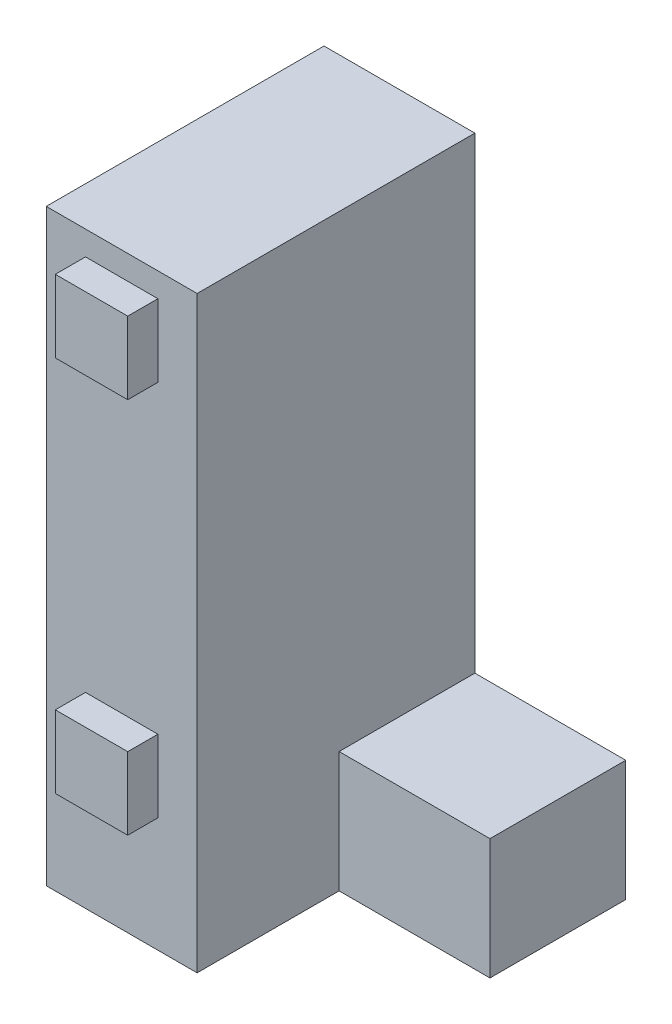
ISO-10303-21;
HEADER;
FILE_DESCRIPTION(('STEP AP214'),'2;1');
FILE_NAME('part.step','',(''),(''),'','','');
FILE_SCHEMA(('AUTOMOTIVE_DESIGN { 1 0 10303 214 1 1 1 1 }'));
ENDSEC;
DATA;
#1=APPLICATION_CONTEXT('core data for automotive mechanical design processes');
#2=APPLICATION_PROTOCOL_DEFINITION('international standard','automotive_design',2000,#1);
#3=PRODUCT_CONTEXT('',#1,'mechanical');
#4=PRODUCT('Part','Part','',(#3));
#5=PRODUCT_RELATED_PRODUCT_CATEGORY('part','',(#4));
#6=PRODUCT_DEFINITION_FORMATION('','',#4);
#7=PRODUCT_DEFINITION_CONTEXT('part definition',#1,'design');
#8=PRODUCT_DEFINITION('design','',#6,#7);
#9=PRODUCT_DEFINITION_SHAPE('','',#8);
#10=(LENGTH_UNIT() NAMED_UNIT(*) SI_UNIT(.MILLI.,.METRE.));
#11=(NAMED_UNIT(*) PLANE_ANGLE_UNIT() SI_UNIT($,.RADIAN.));
#12=(NAMED_UNIT(*) SI_UNIT($,.STERADIAN.) SOLID_ANGLE_UNIT());
#13=UNCERTAINTY_MEASURE_WITH_UNIT(LENGTH_MEASURE(1.E-05),#10,'distance_accuracy_value','');
#14=(GEOMETRIC_REPRESENTATION_CONTEXT(3) GLOBAL_UNCERTAINTY_ASSIGNED_CONTEXT((#13)) GLOBAL_UNIT_ASSIGNED_CONTEXT((#10,
#11,#12)) REPRESENTATION_CONTEXT('',''));
#15=CARTESIAN_POINT('',(0.,0.,0.));
#16=DIRECTION('',(0.,0.,1.));
#17=DIRECTION('',(1.,0.,0.));
#18=AXIS2_PLACEMENT_3D('',#15,#16,#17);
#19=CARTESIAN_POINT('',(73.,250.,-142.943134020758));
#20=DIRECTION('',(0.,0.,1.));
#21=DIRECTION('',(1.,0.,0.));
#22=AXIS2_PLACEMENT_3D('',#19,#20,#21);
#23=PLANE('',#22);
#24=DIRECTION('',(0.,1.,0.));
#25=VECTOR('',#24,1.);
#26=CARTESIAN_POINT('',(30.,250.,-142.943134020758));
#27=LINE('',#26,#25);
#28=CARTESIAN_POINT('',(30.,0.,-142.943134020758));
#29=VERTEX_POINT('',#28);
#30=CARTESIAN_POINT('',(30.,195.,-142.943134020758));
#31=VERTEX_POINT('',#30);
#32=EDGE_CURVE('E333',#29,#31,#27,.T.);
#33=ORIENTED_EDGE('',*,*,#32,.T.);
#34=DIRECTION('',(1.,0.,0.));
#35=VECTOR('',#34,1.);
#36=CARTESIAN_POINT('',(-91.,195.,-142.943134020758));
#37=LINE('',#36,#35);
#38=CARTESIAN_POINT('',(-20.,195.,-142.943134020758));
#39=VERTEX_POINT('',#38);
#40=EDGE_CURVE('E569',#39,#31,#37,.T.);
#41=ORIENTED_EDGE('',*,*,#40,.F.);
#42=DIRECTION('',(0.,-1.,0.));
#43=VECTOR('',#42,1.);
#44=CARTESIAN_POINT('',(-20.,250.,-142.943134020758));
#45=LINE('',#44,#43);
#46=CARTESIAN_POINT('',(-19.9999999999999,0.,-142.943134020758));
#47=VERTEX_POINT('',#46);
#48=EDGE_CURVE('E332',#39,#47,#45,.T.);
#49=ORIENTED_EDGE('',*,*,#48,.T.);
#50=DIRECTION('',(-1.,0.,0.));
#51=VECTOR('',#50,1.);
#52=CARTESIAN_POINT('',(73.,0.,-142.943134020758));
#53=LINE('',#52,#51);
#54=EDGE_CURVE('E328',#29,#47,#53,.T.);
#55=ORIENTED_EDGE('',*,*,#54,.F.);
#56=EDGE_LOOP('',(#33,#41,#49,#55));
#57=FACE_BOUND('',#56,.T.);
#58=DIRECTION('',(-1.,0.,0.));
#59=VECTOR('',#58,1.);
#60=CARTESIAN_POINT('',(-7.,62.,-142.943134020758));
#61=LINE('',#60,#59);
#62=CARTESIAN_POINT('',(17.,62.,-142.943134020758));
#63=VERTEX_POINT('',#62);
#64=CARTESIAN_POINT('',(-7.,62.,-142.943134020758));
#65=VERTEX_POINT('',#64);
#66=EDGE_CURVE('E289',#63,#65,#61,.T.);
#67=ORIENTED_EDGE('',*,*,#66,.F.);
#68=DIRECTION('',(0.,1.,0.));
#69=VECTOR('',#68,1.);
#70=CARTESIAN_POINT('',(17.,38.,-142.943134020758));
#71=LINE('',#70,#69);
#72=CARTESIAN_POINT('',(17.,38.,-142.943134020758));
#73=VERTEX_POINT('',#72);
#74=EDGE_CURVE('E284',#73,#63,#71,.T.);
#75=ORIENTED_EDGE('',*,*,#74,.F.);
#76=DIRECTION('',(1.,0.,0.));
#77=VECTOR('',#76,1.);
#78=CARTESIAN_POINT('',(-7.,38.,-142.943134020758));
#79=LINE('',#78,#77);
#80=CARTESIAN_POINT('',(-6.99999999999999,38.,-142.943134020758));
#81=VERTEX_POINT('',#80);
#82=EDGE_CURVE('E299',#81,#73,#79,.T.);
#83=ORIENTED_EDGE('',*,*,#82,.F.);
#84=DIRECTION('',(0.,-1.,0.));
#85=VECTOR('',#84,1.);
#86=CARTESIAN_POINT('',(-7.,38.,-142.943134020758));
#87=LINE('',#86,#85);
#88=EDGE_CURVE('E311',#65,#81,#87,.T.);
#89=ORIENTED_EDGE('',*,*,#88,.F.);
#90=EDGE_LOOP('',(#67,#75,#83,#89));
#91=FACE_BOUND('',#90,.T.);
#92=DIRECTION('',(-1.,0.,0.));
#93=VECTOR('',#92,1.);
#94=CARTESIAN_POINT('',(-7.00000000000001,187.,-142.943134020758));
#95=LINE('',#94,#93);
#96=CARTESIAN_POINT('',(17.,187.,-142.943134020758));
#97=VERTEX_POINT('',#96);
#98=CARTESIAN_POINT('',(-7.00000000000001,187.,-142.943134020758));
#99=VERTEX_POINT('',#98);
#100=EDGE_CURVE('E1091',#97,#99,#95,.T.);
#101=ORIENTED_EDGE('',*,*,#100,.F.);
#102=DIRECTION('',(0.,1.,0.));
#103=VECTOR('',#102,1.);
#104=CARTESIAN_POINT('',(17.,163.,-142.943134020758));
#105=LINE('',#104,#103);
#106=CARTESIAN_POINT('',(17.,163.,-142.943134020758));
#107=VERTEX_POINT('',#106);
#108=EDGE_CURVE('E281',#107,#97,#105,.T.);
#109=ORIENTED_EDGE('',*,*,#108,.F.);
#110=DIRECTION('',(1.,0.,0.));
#111=VECTOR('',#110,1.);
#112=CARTESIAN_POINT('',(-7.00000000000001,163.,-142.943134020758));
#113=LINE('',#112,#111);
#114=CARTESIAN_POINT('',(-7.00000000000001,163.,-142.943134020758));
#115=VERTEX_POINT('',#114);
#116=EDGE_CURVE('E277',#115,#107,#113,.T.);
#117=ORIENTED_EDGE('',*,*,#116,.F.);
#118=DIRECTION('',(0.,-1.,0.));
#119=VECTOR('',#118,1.);
#120=CARTESIAN_POINT('',(-7.00000000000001,163.,-142.943134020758));
#121=LINE('',#120,#119);
#122=EDGE_CURVE('E1087',#99,#115,#121,.T.);
#123=ORIENTED_EDGE('',*,*,#122,.F.);
#124=EDGE_LOOP('',(#101,#109,#117,#123));
#125=FACE_BOUND('',#124,.T.);
#126=ADVANCED_FACE('F52',(#57,#91,#125),#23,.T.);
#127=CARTESIAN_POINT('',(-20.,250.,0.));
#128=DIRECTION('',(1.,0.,0.));
#129=DIRECTION('',(0.,0.,-1.));
#130=AXIS2_PLACEMENT_3D('',#127,#128,#129);
#131=PLANE('',#130);
#132=ORIENTED_EDGE('',*,*,#48,.F.);
#133=DIRECTION('',(0.,0.,-1.));
#134=VECTOR('',#133,1.);
#135=CARTESIAN_POINT('',(-20.,195.,0.));
#136=LINE('',#135,#134);
#137=CARTESIAN_POINT('',(-19.9999999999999,195.,-235.));
#138=VERTEX_POINT('',#137);
#139=EDGE_CURVE('E61',#39,#138,#136,.T.);
#140=ORIENTED_EDGE('',*,*,#139,.T.);
#141=DIRECTION('',(0.,-1.,0.));
#142=VECTOR('',#141,1.);
#143=CARTESIAN_POINT('',(-20.,250.,-235.));
#144=LINE('',#143,#142);
#145=CARTESIAN_POINT('',(-19.9999999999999,0.,-235.));
#146=VERTEX_POINT('',#145);
#147=EDGE_CURVE('E561',#138,#146,#144,.T.);
#148=ORIENTED_EDGE('',*,*,#147,.T.);
#149=DIRECTION('',(0.,0.,-1.));
#150=VECTOR('',#149,1.);
#151=CARTESIAN_POINT('',(-20.,0.,0.));
#152=LINE('',#151,#150);
#153=EDGE_CURVE('E547',#47,#146,#152,.T.);
#154=ORIENTED_EDGE('',*,*,#153,.F.);
#155=EDGE_LOOP('',(#132,#140,#148,#154));
#156=FACE_BOUND('',#155,.T.);
#157=ADVANCED_FACE('F577',(#156),#131,.F.);
#158=CARTESIAN_POINT('',(30.,250.,-150.));
#159=DIRECTION('',(-1.,0.,0.));
#160=DIRECTION('',(0.,0.,1.));
#161=AXIS2_PLACEMENT_3D('',#158,#159,#160);
#162=PLANE('',#161);
#163=ORIENTED_EDGE('',*,*,#32,.F.);
#164=DIRECTION('',(0.,0.,1.));
#165=VECTOR('',#164,1.);
#166=CARTESIAN_POINT('',(30.,0.,-235.));
#167=LINE('',#166,#165);
#168=CARTESIAN_POINT('',(30.,0.,-190.));
#169=VERTEX_POINT('',#168);
#170=EDGE_CURVE('E540',#169,#29,#167,.T.);
#171=ORIENTED_EDGE('',*,*,#170,.F.);
#172=DIRECTION('',(0.,1.,0.));
#173=VECTOR('',#172,1.);
#174=CARTESIAN_POINT('',(30.,0.,-190.));
#175=LINE('',#174,#173);
#176=CARTESIAN_POINT('',(30.,40.,-190.));
#177=VERTEX_POINT('',#176);
#178=EDGE_CURVE('E524',#169,#177,#175,.T.);
#179=ORIENTED_EDGE('',*,*,#178,.T.);
#180=DIRECTION('',(0.,0.,1.));
#181=VECTOR('',#180,1.);
#182=CARTESIAN_POINT('',(30.,40.,-190.));
#183=LINE('',#182,#181);
#184=CARTESIAN_POINT('',(30.,40.,-235.));
#185=VERTEX_POINT('',#184);
#186=EDGE_CURVE('E375',#185,#177,#183,.T.);
#187=ORIENTED_EDGE('',*,*,#186,.F.);
#188=DIRECTION('',(0.,1.,0.));
#189=VECTOR('',#188,1.);
#190=CARTESIAN_POINT('',(30.,250.,-235.));
#191=LINE('',#190,#189);
#192=CARTESIAN_POINT('',(30.,195.,-235.));
#193=VERTEX_POINT('',#192);
#194=EDGE_CURVE('E12',#185,#193,#191,.T.);
#195=ORIENTED_EDGE('',*,*,#194,.T.);
#196=DIRECTION('',(0.,0.,-1.));
#197=VECTOR('',#196,1.);
#198=CARTESIAN_POINT('',(30.,195.,-142.943134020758));
#199=LINE('',#198,#197);
#200=EDGE_CURVE('E565',#31,#193,#199,.T.);
#201=ORIENTED_EDGE('',*,*,#200,.F.);
#202=EDGE_LOOP('',(#163,#171,#179,#187,#195,#201));
#203=FACE_BOUND('',#202,.T.);
#204=ADVANCED_FACE('F54',(#203),#162,.F.);
#205=CARTESIAN_POINT('',(0.,0.,0.));
#206=DIRECTION('',(0.,-1.,0.));
#207=DIRECTION('',(0.,0.,-1.));
#208=AXIS2_PLACEMENT_3D('',#205,#206,#207);
#209=PLANE('',#208);
#210=ORIENTED_EDGE('',*,*,#170,.T.);
#211=ORIENTED_EDGE('',*,*,#54,.T.);
#212=ORIENTED_EDGE('',*,*,#153,.T.);
#213=DIRECTION('',(-1.,0.,0.));
#214=VECTOR('',#213,1.);
#215=CARTESIAN_POINT('',(0.,0.,-235.));
#216=LINE('',#215,#214);
#217=CARTESIAN_POINT('',(80.,0.,-235.));
#218=VERTEX_POINT('',#217);
#219=EDGE_CURVE('E557',#218,#146,#216,.T.);
#220=ORIENTED_EDGE('',*,*,#219,.F.);
#221=DIRECTION('',(0.,0.,-1.));
#222=VECTOR('',#221,1.);
#223=CARTESIAN_POINT('',(80.,0.,-235.));
#224=LINE('',#223,#222);
#225=CARTESIAN_POINT('',(80.,0.,-190.));
#226=VERTEX_POINT('',#225);
#227=EDGE_CURVE('E519',#226,#218,#224,.T.);
#228=ORIENTED_EDGE('',*,*,#227,.F.);
#229=DIRECTION('',(1.,0.,0.));
#230=VECTOR('',#229,1.);
#231=CARTESIAN_POINT('',(80.,0.,-190.));
#232=LINE('',#231,#230);
#233=EDGE_CURVE('E515',#169,#226,#232,.T.);
#234=ORIENTED_EDGE('',*,*,#233,.F.);
#235=EDGE_LOOP('',(#210,#211,#212,#220,#228,#234));
#236=FACE_BOUND('',#235,.T.);
#237=ADVANCED_FACE('F590',(#236),#209,.T.);
#238=CARTESIAN_POINT('',(0.,195.,0.));
#239=DIRECTION('',(0.,-1.,0.));
#240=DIRECTION('',(0.,0.,-1.));
#241=AXIS2_PLACEMENT_3D('',#238,#239,#240);
#242=PLANE('',#241);
#243=ORIENTED_EDGE('',*,*,#200,.T.);
#244=DIRECTION('',(1.,0.,0.));
#245=VECTOR('',#244,1.);
#246=CARTESIAN_POINT('',(230.,195.,-235.));
#247=LINE('',#246,#245);
#248=EDGE_CURVE('E550',#138,#193,#247,.T.);
#249=ORIENTED_EDGE('',*,*,#248,.F.);
#250=ORIENTED_EDGE('',*,*,#139,.F.);
#251=ORIENTED_EDGE('',*,*,#40,.T.);
#252=EDGE_LOOP('',(#243,#249,#250,#251));
#253=FACE_BOUND('',#252,.T.);
#254=ADVANCED_FACE('F581',(#253),#242,.F.);
#255=CARTESIAN_POINT('',(230.,-105.,-235.));
#256=DIRECTION('',(0.,0.,1.));
#257=DIRECTION('',(1.,0.,0.));
#258=AXIS2_PLACEMENT_3D('',#255,#256,#257);
#259=PLANE('',#258);
#260=DIRECTION('',(0.,-1.,0.));
#261=VECTOR('',#260,1.);
#262=CARTESIAN_POINT('',(15.075,162.075,-235.));
#263=LINE('',#262,#261);
#264=CARTESIAN_POINT('',(15.075,162.075,-235.));
#265=VERTEX_POINT('',#264);
#266=CARTESIAN_POINT('',(15.075,141.925,-235.));
#267=VERTEX_POINT('',#266);
#268=EDGE_CURVE('E360',#265,#267,#263,.T.);
#269=ORIENTED_EDGE('',*,*,#268,.F.);
#270=DIRECTION('',(1.,0.,0.));
#271=VECTOR('',#270,1.);
#272=CARTESIAN_POINT('',(-5.07500000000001,162.075,-235.));
#273=LINE('',#272,#271);
#274=CARTESIAN_POINT('',(-5.07500000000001,162.075,-235.));
#275=VERTEX_POINT('',#274);
#276=EDGE_CURVE('E357',#275,#265,#273,.T.);
#277=ORIENTED_EDGE('',*,*,#276,.F.);
#278=DIRECTION('',(0.,1.,0.));
#279=VECTOR('',#278,1.);
#280=CARTESIAN_POINT('',(-5.07500000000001,141.925,-235.));
#281=LINE('',#280,#279);
#282=CARTESIAN_POINT('',(-5.07500000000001,141.925,-235.));
#283=VERTEX_POINT('',#282);
#284=EDGE_CURVE('E344',#283,#275,#281,.T.);
#285=ORIENTED_EDGE('',*,*,#284,.F.);
#286=DIRECTION('',(-1.,0.,0.));
#287=VECTOR('',#286,1.);
#288=CARTESIAN_POINT('',(15.075,141.925,-235.));
#289=LINE('',#288,#287);
#290=EDGE_CURVE('E365',#267,#283,#289,.T.);
#291=ORIENTED_EDGE('',*,*,#290,.F.);
#292=EDGE_LOOP('',(#269,#277,#285,#291));
#293=FACE_BOUND('',#292,.T.);
#294=DIRECTION('',(0.,-1.,0.));
#295=VECTOR('',#294,1.);
#296=CARTESIAN_POINT('',(15.075,109.075,-235.));
#297=LINE('',#296,#295);
#298=CARTESIAN_POINT('',(15.075,109.075,-235.));
#299=VERTEX_POINT('',#298);
#300=CARTESIAN_POINT('',(15.075,88.925,-235.));
#301=VERTEX_POINT('',#300);
#302=EDGE_CURVE('E409',#299,#301,#297,.T.);
#303=ORIENTED_EDGE('',*,*,#302,.F.);
#304=DIRECTION('',(1.,0.,0.));
#305=VECTOR('',#304,1.);
#306=CARTESIAN_POINT('',(-5.07499999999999,109.075,-235.));
#307=LINE('',#306,#305);
#308=CARTESIAN_POINT('',(-5.07499999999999,109.075,-235.));
#309=VERTEX_POINT('',#308);
#310=EDGE_CURVE('E361',#309,#299,#307,.T.);
#311=ORIENTED_EDGE('',*,*,#310,.F.);
#312=DIRECTION('',(0.,1.,0.));
#313=VECTOR('',#312,1.);
#314=CARTESIAN_POINT('',(-5.07499999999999,88.925,-235.));
#315=LINE('',#314,#313);
#316=CARTESIAN_POINT('',(-5.07499999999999,88.925,-235.));
#317=VERTEX_POINT('',#316);
#318=EDGE_CURVE('E400',#317,#309,#315,.T.);
#319=ORIENTED_EDGE('',*,*,#318,.F.);
#320=DIRECTION('',(-1.,0.,0.));
#321=VECTOR('',#320,1.);
#322=CARTESIAN_POINT('',(15.075,88.925,-235.));
#323=LINE('',#322,#321);
#324=EDGE_CURVE('E404',#301,#317,#323,.T.);
#325=ORIENTED_EDGE('',*,*,#324,.F.);
#326=EDGE_LOOP('',(#303,#311,#319,#325));
#327=FACE_BOUND('',#326,.T.);
#328=DIRECTION('',(0.,-1.,0.));
#329=VECTOR('',#328,1.);
#330=CARTESIAN_POINT('',(15.075,56.075,-235.));
#331=LINE('',#330,#329);
#332=CARTESIAN_POINT('',(15.075,56.075,-235.));
#333=VERTEX_POINT('',#332);
#334=CARTESIAN_POINT('',(15.075,35.925,-235.));
#335=VERTEX_POINT('',#334);
#336=EDGE_CURVE('E453',#333,#335,#331,.T.);
#337=ORIENTED_EDGE('',*,*,#336,.F.);
#338=DIRECTION('',(1.,0.,0.));
#339=VECTOR('',#338,1.);
#340=CARTESIAN_POINT('',(-5.07500000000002,56.075,-235.));
#341=LINE('',#340,#339);
#342=CARTESIAN_POINT('',(-5.07500000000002,56.075,-235.));
#343=VERTEX_POINT('',#342);
#344=EDGE_CURVE('E399',#343,#333,#341,.T.);
#345=ORIENTED_EDGE('',*,*,#344,.F.);
#346=DIRECTION('',(0.,1.,0.));
#347=VECTOR('',#346,1.);
#348=CARTESIAN_POINT('',(-5.07500000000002,35.925,-235.));
#349=LINE('',#348,#347);
#350=CARTESIAN_POINT('',(-5.07500000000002,35.925,-235.));
#351=VERTEX_POINT('',#350);
#352=EDGE_CURVE('E444',#351,#343,#349,.T.);
#353=ORIENTED_EDGE('',*,*,#352,.F.);
#354=DIRECTION('',(-1.,0.,0.));
#355=VECTOR('',#354,1.);
#356=CARTESIAN_POINT('',(15.075,35.925,-235.));
#357=LINE('',#356,#355);
#358=EDGE_CURVE('E448',#335,#351,#357,.T.);
#359=ORIENTED_EDGE('',*,*,#358,.F.);
#360=EDGE_LOOP('',(#337,#345,#353,#359));
#361=FACE_BOUND('',#360,.T.);
#362=DIRECTION('',(0.,-1.,0.));
#363=VECTOR('',#362,1.);
#364=CARTESIAN_POINT('',(62.075,30.075,-235.));
#365=LINE('',#364,#363);
#366=CARTESIAN_POINT('',(62.075,30.075,-235.));
#367=VERTEX_POINT('',#366);
#368=CARTESIAN_POINT('',(62.075,9.92500000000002,-235.));
#369=VERTEX_POINT('',#368);
#370=EDGE_CURVE('E495',#367,#369,#365,.T.);
#371=ORIENTED_EDGE('',*,*,#370,.F.);
#372=DIRECTION('',(1.,0.,0.));
#373=VECTOR('',#372,1.);
#374=CARTESIAN_POINT('',(41.925,30.075,-235.));
#375=LINE('',#374,#373);
#376=CARTESIAN_POINT('',(41.925,30.075,-235.));
#377=VERTEX_POINT('',#376);
#378=EDGE_CURVE('E443',#377,#367,#375,.T.);
#379=ORIENTED_EDGE('',*,*,#378,.F.);
#380=DIRECTION('',(0.,1.,0.));
#381=VECTOR('',#380,1.);
#382=CARTESIAN_POINT('',(41.925,9.92500000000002,-235.));
#383=LINE('',#382,#381);
#384=CARTESIAN_POINT('',(41.925,9.92500000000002,-235.));
#385=VERTEX_POINT('',#384);
#386=EDGE_CURVE('E486',#385,#377,#383,.T.);
#387=ORIENTED_EDGE('',*,*,#386,.F.);
#388=DIRECTION('',(-1.,0.,0.));
#389=VECTOR('',#388,1.);
#390=CARTESIAN_POINT('',(62.075,9.92500000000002,-235.));
#391=LINE('',#390,#389);
#392=EDGE_CURVE('E490',#369,#385,#391,.T.);
#393=ORIENTED_EDGE('',*,*,#392,.F.);
#394=EDGE_LOOP('',(#371,#379,#387,#393));
#395=FACE_BOUND('',#394,.T.);
#396=ORIENTED_EDGE('',*,*,#219,.T.);
#397=ORIENTED_EDGE('',*,*,#147,.F.);
#398=ORIENTED_EDGE('',*,*,#248,.T.);
#399=ORIENTED_EDGE('',*,*,#194,.F.);
#400=DIRECTION('',(-1.,0.,0.));
#401=VECTOR('',#400,1.);
#402=CARTESIAN_POINT('',(30.,40.,-235.));
#403=LINE('',#402,#401);
#404=CARTESIAN_POINT('',(80.,40.,-235.));
#405=VERTEX_POINT('',#404);
#406=EDGE_CURVE('E520',#405,#185,#403,.T.);
#407=ORIENTED_EDGE('',*,*,#406,.F.);
#408=DIRECTION('',(0.,1.,0.));
#409=VECTOR('',#408,1.);
#410=CARTESIAN_POINT('',(80.,0.,-235.));
#411=LINE('',#410,#409);
#412=EDGE_CURVE('E537',#218,#405,#411,.T.);
#413=ORIENTED_EDGE('',*,*,#412,.F.);
#414=EDGE_LOOP('',(#396,#397,#398,#399,#407,#413));
#415=FACE_BOUND('',#414,.T.);
#416=ADVANCED_FACE('F585',(#293,#327,#361,#395,#415),#259,.F.);
#417=CARTESIAN_POINT('',(80.,0.,-235.));
#418=DIRECTION('',(1.,0.,0.));
#419=DIRECTION('',(0.,0.,-1.));
#420=AXIS2_PLACEMENT_3D('',#417,#418,#419);
#421=PLANE('',#420);
#422=DIRECTION('',(0.,0.,-1.));
#423=VECTOR('',#422,1.);
#424=CARTESIAN_POINT('',(80.,40.,-235.));
#425=LINE('',#424,#423);
#426=CARTESIAN_POINT('',(80.,40.,-190.));
#427=VERTEX_POINT('',#426);
#428=EDGE_CURVE('E531',#427,#405,#425,.T.);
#429=ORIENTED_EDGE('',*,*,#428,.F.);
#430=DIRECTION('',(0.,1.,0.));
#431=VECTOR('',#430,1.);
#432=CARTESIAN_POINT('',(80.,0.,-190.));
#433=LINE('',#432,#431);
#434=EDGE_CURVE('E541',#226,#427,#433,.T.);
#435=ORIENTED_EDGE('',*,*,#434,.F.);
#436=ORIENTED_EDGE('',*,*,#227,.T.);
#437=ORIENTED_EDGE('',*,*,#412,.T.);
#438=EDGE_LOOP('',(#429,#435,#436,#437));
#439=FACE_BOUND('',#438,.T.);
#440=ADVANCED_FACE('F605',(#439),#421,.T.);
#441=CARTESIAN_POINT('',(80.,0.,-190.));
#442=DIRECTION('',(0.,0.,1.));
#443=DIRECTION('',(1.,0.,0.));
#444=AXIS2_PLACEMENT_3D('',#441,#442,#443);
#445=PLANE('',#444);
#446=DIRECTION('',(1.,0.,0.));
#447=VECTOR('',#446,1.);
#448=CARTESIAN_POINT('',(80.,40.,-190.));
#449=LINE('',#448,#447);
#450=EDGE_CURVE('E527',#177,#427,#449,.T.);
#451=ORIENTED_EDGE('',*,*,#450,.F.);
#452=ORIENTED_EDGE('',*,*,#178,.F.);
#453=ORIENTED_EDGE('',*,*,#233,.T.);
#454=ORIENTED_EDGE('',*,*,#434,.T.);
#455=EDGE_LOOP('',(#451,#452,#453,#454));
#456=FACE_BOUND('',#455,.T.);
#457=ADVANCED_FACE('F602',(#456),#445,.T.);
#458=CARTESIAN_POINT('',(0.,40.,0.));
#459=DIRECTION('',(0.,-1.,0.));
#460=DIRECTION('',(0.,0.,-1.));
#461=AXIS2_PLACEMENT_3D('',#458,#459,#460);
#462=PLANE('',#461);
#463=ORIENTED_EDGE('',*,*,#186,.T.);
#464=ORIENTED_EDGE('',*,*,#450,.T.);
#465=ORIENTED_EDGE('',*,*,#428,.T.);
#466=ORIENTED_EDGE('',*,*,#406,.T.);
#467=EDGE_LOOP('',(#463,#464,#465,#466));
#468=FACE_BOUND('',#467,.T.);
#469=ADVANCED_FACE('F600',(#468),#462,.F.);
#470=CARTESIAN_POINT('',(41.925,30.075,-203.5));
#471=DIRECTION('',(0.,1.,0.));
#472=DIRECTION('',(-1.,0.,0.));
#473=AXIS2_PLACEMENT_3D('',#470,#471,#472);
#474=PLANE('',#473);
#475=ORIENTED_EDGE('',*,*,#378,.T.);
#476=DIRECTION('',(0.,0.,-1.));
#477=VECTOR('',#476,1.);
#478=CARTESIAN_POINT('',(62.075,30.075,-203.5));
#479=LINE('',#478,#477);
#480=CARTESIAN_POINT('',(62.075,30.075,-203.5));
#481=VERTEX_POINT('',#480);
#482=EDGE_CURVE('E473',#481,#367,#479,.T.);
#483=ORIENTED_EDGE('',*,*,#482,.F.);
#484=DIRECTION('',(1.,0.,0.));
#485=VECTOR('',#484,1.);
#486=CARTESIAN_POINT('',(41.925,30.075,-203.5));
#487=LINE('',#486,#485);
#488=CARTESIAN_POINT('',(41.925,30.075,-203.5));
#489=VERTEX_POINT('',#488);
#490=EDGE_CURVE('E491',#489,#481,#487,.T.);
#491=ORIENTED_EDGE('',*,*,#490,.F.);
#492=DIRECTION('',(0.,0.,-1.));
#493=VECTOR('',#492,1.);
#494=CARTESIAN_POINT('',(41.925,30.075,-203.5));
#495=LINE('',#494,#493);
#496=EDGE_CURVE('E336',#489,#377,#495,.T.);
#497=ORIENTED_EDGE('',*,*,#496,.T.);
#498=EDGE_LOOP('',(#475,#483,#491,#497));
#499=FACE_BOUND('',#498,.T.);
#500=ADVANCED_FACE('F688',(#499),#474,.F.);
#501=CARTESIAN_POINT('',(41.925,9.92500000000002,-203.5));
#502=DIRECTION('',(-1.,0.,0.));
#503=DIRECTION('',(0.,0.,1.));
#504=AXIS2_PLACEMENT_3D('',#501,#502,#503);
#505=PLANE('',#504);
#506=ORIENTED_EDGE('',*,*,#386,.T.);
#507=ORIENTED_EDGE('',*,*,#496,.F.);
#508=DIRECTION('',(0.,1.,0.));
#509=VECTOR('',#508,1.);
#510=CARTESIAN_POINT('',(41.925,9.92500000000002,-203.5));
#511=LINE('',#510,#509);
#512=CARTESIAN_POINT('',(41.925,9.92500000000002,-203.5));
#513=VERTEX_POINT('',#512);
#514=EDGE_CURVE('E477',#513,#489,#511,.T.);
#515=ORIENTED_EDGE('',*,*,#514,.F.);
#516=DIRECTION('',(0.,0.,-1.));
#517=VECTOR('',#516,1.);
#518=CARTESIAN_POINT('',(41.925,9.92500000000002,-203.5));
#519=LINE('',#518,#517);
#520=EDGE_CURVE('E481',#513,#385,#519,.T.);
#521=ORIENTED_EDGE('',*,*,#520,.T.);
#522=EDGE_LOOP('',(#506,#507,#515,#521));
#523=FACE_BOUND('',#522,.T.);
#524=ADVANCED_FACE('F691',(#523),#505,.F.);
#525=CARTESIAN_POINT('',(62.075,9.92500000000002,-203.5));
#526=DIRECTION('',(0.,-1.,0.));
#527=DIRECTION('',(1.,0.,0.));
#528=AXIS2_PLACEMENT_3D('',#525,#526,#527);
#529=PLANE('',#528);
#530=ORIENTED_EDGE('',*,*,#392,.T.);
#531=ORIENTED_EDGE('',*,*,#520,.F.);
#532=DIRECTION('',(-1.,0.,0.));
#533=VECTOR('',#532,1.);
#534=CARTESIAN_POINT('',(62.075,9.92500000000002,-203.5));
#535=LINE('',#534,#533);
#536=CARTESIAN_POINT('',(62.075,9.92500000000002,-203.5));
#537=VERTEX_POINT('',#536);
#538=EDGE_CURVE('E504',#537,#513,#535,.T.);
#539=ORIENTED_EDGE('',*,*,#538,.F.);
#540=DIRECTION('',(0.,0.,-1.));
#541=VECTOR('',#540,1.);
#542=CARTESIAN_POINT('',(62.075,9.92500000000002,-203.5));
#543=LINE('',#542,#541);
#544=EDGE_CURVE('E478',#537,#369,#543,.T.);
#545=ORIENTED_EDGE('',*,*,#544,.T.);
#546=EDGE_LOOP('',(#530,#531,#539,#545));
#547=FACE_BOUND('',#546,.T.);
#548=ADVANCED_FACE('F696',(#547),#529,.F.);
#549=CARTESIAN_POINT('',(62.075,30.075,-203.5));
#550=DIRECTION('',(1.,0.,0.));
#551=DIRECTION('',(0.,0.,-1.));
#552=AXIS2_PLACEMENT_3D('',#549,#550,#551);
#553=PLANE('',#552);
#554=ORIENTED_EDGE('',*,*,#370,.T.);
#555=ORIENTED_EDGE('',*,*,#544,.F.);
#556=DIRECTION('',(0.,-1.,0.));
#557=VECTOR('',#556,1.);
#558=CARTESIAN_POINT('',(62.075,30.075,-203.5));
#559=LINE('',#558,#557);
#560=EDGE_CURVE('E508',#481,#537,#559,.T.);
#561=ORIENTED_EDGE('',*,*,#560,.F.);
#562=ORIENTED_EDGE('',*,*,#482,.T.);
#563=EDGE_LOOP('',(#554,#555,#561,#562));
#564=FACE_BOUND('',#563,.T.);
#565=ADVANCED_FACE('F693',(#564),#553,.F.);
#566=CARTESIAN_POINT('',(0.,0.,-203.5));
#567=DIRECTION('',(0.,0.,-1.));
#568=DIRECTION('',(-1.,0.,0.));
#569=AXIS2_PLACEMENT_3D('',#566,#567,#568);
#570=PLANE('',#569);
#571=ORIENTED_EDGE('',*,*,#490,.T.);
#572=ORIENTED_EDGE('',*,*,#560,.T.);
#573=ORIENTED_EDGE('',*,*,#538,.T.);
#574=ORIENTED_EDGE('',*,*,#514,.T.);
#575=EDGE_LOOP('',(#571,#572,#573,#574));
#576=FACE_BOUND('',#575,.T.);
#577=ADVANCED_FACE('F672',(#576),#570,.T.);
#578=CARTESIAN_POINT('',(-5.07500000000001,56.075,-203.5));
#579=DIRECTION('',(0.,1.,0.));
#580=DIRECTION('',(0.,0.,1.));
#581=AXIS2_PLACEMENT_3D('',#578,#579,#580);
#582=PLANE('',#581);
#583=ORIENTED_EDGE('',*,*,#344,.T.);
#584=DIRECTION('',(0.,0.,-1.));
#585=VECTOR('',#584,1.);
#586=CARTESIAN_POINT('',(15.075,56.075,-203.5));
#587=LINE('',#586,#585);
#588=CARTESIAN_POINT('',(15.075,56.075,-203.5));
#589=VERTEX_POINT('',#588);
#590=EDGE_CURVE('E429',#589,#333,#587,.T.);
#591=ORIENTED_EDGE('',*,*,#590,.F.);
#592=DIRECTION('',(1.,0.,0.));
#593=VECTOR('',#592,1.);
#594=CARTESIAN_POINT('',(-5.07500000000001,56.075,-203.5));
#595=LINE('',#594,#593);
#596=CARTESIAN_POINT('',(-5.07500000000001,56.075,-203.5));
#597=VERTEX_POINT('',#596);
#598=EDGE_CURVE('E449',#597,#589,#595,.T.);
#599=ORIENTED_EDGE('',*,*,#598,.F.);
#600=DIRECTION('',(0.,0.,-1.));
#601=VECTOR('',#600,1.);
#602=CARTESIAN_POINT('',(-5.07500000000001,56.075,-203.5));
#603=LINE('',#602,#601);
#604=EDGE_CURVE('E440',#597,#343,#603,.T.);
#605=ORIENTED_EDGE('',*,*,#604,.T.);
#606=EDGE_LOOP('',(#583,#591,#599,#605));
#607=FACE_BOUND('',#606,.T.);
#608=ADVANCED_FACE('F668',(#607),#582,.F.);
#609=CARTESIAN_POINT('',(-5.07500000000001,35.925,-203.5));
#610=DIRECTION('',(-1.,0.,0.));
#611=DIRECTION('',(0.,0.,1.));
#612=AXIS2_PLACEMENT_3D('',#609,#610,#611);
#613=PLANE('',#612);
#614=ORIENTED_EDGE('',*,*,#352,.T.);
#615=ORIENTED_EDGE('',*,*,#604,.F.);
#616=DIRECTION('',(0.,1.,0.));
#617=VECTOR('',#616,1.);
#618=CARTESIAN_POINT('',(-5.07500000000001,35.925,-203.5));
#619=LINE('',#618,#617);
#620=CARTESIAN_POINT('',(-5.07500000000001,35.925,-203.5));
#621=VERTEX_POINT('',#620);
#622=EDGE_CURVE('E433',#621,#597,#619,.T.);
#623=ORIENTED_EDGE('',*,*,#622,.F.);
#624=DIRECTION('',(0.,0.,-1.));
#625=VECTOR('',#624,1.);
#626=CARTESIAN_POINT('',(-5.07500000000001,35.925,-203.5));
#627=LINE('',#626,#625);
#628=EDGE_CURVE('E437',#621,#351,#627,.T.);
#629=ORIENTED_EDGE('',*,*,#628,.T.);
#630=EDGE_LOOP('',(#614,#615,#623,#629));
#631=FACE_BOUND('',#630,.T.);
#632=ADVANCED_FACE('F671',(#631),#613,.F.);
#633=CARTESIAN_POINT('',(15.075,35.925,-203.5));
#634=DIRECTION('',(0.,-1.,0.));
#635=DIRECTION('',(1.,0.,0.));
#636=AXIS2_PLACEMENT_3D('',#633,#634,#635);
#637=PLANE('',#636);
#638=ORIENTED_EDGE('',*,*,#358,.T.);
#639=ORIENTED_EDGE('',*,*,#628,.F.);
#640=DIRECTION('',(-1.,0.,0.));
#641=VECTOR('',#640,1.);
#642=CARTESIAN_POINT('',(15.075,35.925,-203.5));
#643=LINE('',#642,#641);
#644=CARTESIAN_POINT('',(15.075,35.925,-203.5));
#645=VERTEX_POINT('',#644);
#646=EDGE_CURVE('E462',#645,#621,#643,.T.);
#647=ORIENTED_EDGE('',*,*,#646,.F.);
#648=DIRECTION('',(0.,0.,-1.));
#649=VECTOR('',#648,1.);
#650=CARTESIAN_POINT('',(15.075,35.925,-203.5));
#651=LINE('',#650,#649);
#652=EDGE_CURVE('E434',#645,#335,#651,.T.);
#653=ORIENTED_EDGE('',*,*,#652,.T.);
#654=EDGE_LOOP('',(#638,#639,#647,#653));
#655=FACE_BOUND('',#654,.T.);
#656=ADVANCED_FACE('F677',(#655),#637,.F.);
#657=CARTESIAN_POINT('',(15.075,56.075,-203.5));
#658=DIRECTION('',(1.,0.,0.));
#659=DIRECTION('',(0.,1.,0.));
#660=AXIS2_PLACEMENT_3D('',#657,#658,#659);
#661=PLANE('',#660);
#662=ORIENTED_EDGE('',*,*,#336,.T.);
#663=ORIENTED_EDGE('',*,*,#652,.F.);
#664=DIRECTION('',(0.,-1.,0.));
#665=VECTOR('',#664,1.);
#666=CARTESIAN_POINT('',(15.075,56.075,-203.5));
#667=LINE('',#666,#665);
#668=EDGE_CURVE('E466',#589,#645,#667,.T.);
#669=ORIENTED_EDGE('',*,*,#668,.F.);
#670=ORIENTED_EDGE('',*,*,#590,.T.);
#671=EDGE_LOOP('',(#662,#663,#669,#670));
#672=FACE_BOUND('',#671,.T.);
#673=ADVANCED_FACE('F674',(#672),#661,.F.);
#674=CARTESIAN_POINT('',(0.,0.,-203.5));
#675=DIRECTION('',(0.,0.,-1.));
#676=DIRECTION('',(-1.,0.,0.));
#677=AXIS2_PLACEMENT_3D('',#674,#675,#676);
#678=PLANE('',#677);
#679=ORIENTED_EDGE('',*,*,#598,.T.);
#680=ORIENTED_EDGE('',*,*,#668,.T.);
#681=ORIENTED_EDGE('',*,*,#646,.T.);
#682=ORIENTED_EDGE('',*,*,#622,.T.);
#683=EDGE_LOOP('',(#679,#680,#681,#682));
#684=FACE_BOUND('',#683,.T.);
#685=ADVANCED_FACE('F652',(#684),#678,.T.);
#686=CARTESIAN_POINT('',(-5.07499999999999,109.075,-203.5));
#687=DIRECTION('',(0.,1.,0.));
#688=DIRECTION('',(0.,0.,1.));
#689=AXIS2_PLACEMENT_3D('',#686,#687,#688);
#690=PLANE('',#689);
#691=ORIENTED_EDGE('',*,*,#310,.T.);
#692=DIRECTION('',(0.,0.,-1.));
#693=VECTOR('',#692,1.);
#694=CARTESIAN_POINT('',(15.075,109.075,-203.5));
#695=LINE('',#694,#693);
#696=CARTESIAN_POINT('',(15.075,109.075,-203.5));
#697=VERTEX_POINT('',#696);
#698=EDGE_CURVE('E385',#697,#299,#695,.T.);
#699=ORIENTED_EDGE('',*,*,#698,.F.);
#700=DIRECTION('',(1.,0.,0.));
#701=VECTOR('',#700,1.);
#702=CARTESIAN_POINT('',(-5.07499999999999,109.075,-203.5));
#703=LINE('',#702,#701);
#704=CARTESIAN_POINT('',(-5.07499999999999,109.075,-203.5));
#705=VERTEX_POINT('',#704);
#706=EDGE_CURVE('E405',#705,#697,#703,.T.);
#707=ORIENTED_EDGE('',*,*,#706,.F.);
#708=DIRECTION('',(0.,0.,-1.));
#709=VECTOR('',#708,1.);
#710=CARTESIAN_POINT('',(-5.07499999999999,109.075,-203.5));
#711=LINE('',#710,#709);
#712=EDGE_CURVE('E396',#705,#309,#711,.T.);
#713=ORIENTED_EDGE('',*,*,#712,.T.);
#714=EDGE_LOOP('',(#691,#699,#707,#713));
#715=FACE_BOUND('',#714,.T.);
#716=ADVANCED_FACE('F648',(#715),#690,.F.);
#717=CARTESIAN_POINT('',(-5.07499999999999,88.925,-203.5));
#718=DIRECTION('',(-1.,0.,0.));
#719=DIRECTION('',(0.,0.,1.));
#720=AXIS2_PLACEMENT_3D('',#717,#718,#719);
#721=PLANE('',#720);
#722=ORIENTED_EDGE('',*,*,#318,.T.);
#723=ORIENTED_EDGE('',*,*,#712,.F.);
#724=DIRECTION('',(0.,1.,0.));
#725=VECTOR('',#724,1.);
#726=CARTESIAN_POINT('',(-5.07499999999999,88.925,-203.5));
#727=LINE('',#726,#725);
#728=CARTESIAN_POINT('',(-5.07499999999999,88.925,-203.5));
#729=VERTEX_POINT('',#728);
#730=EDGE_CURVE('E389',#729,#705,#727,.T.);
#731=ORIENTED_EDGE('',*,*,#730,.F.);
#732=DIRECTION('',(0.,0.,-1.));
#733=VECTOR('',#732,1.);
#734=CARTESIAN_POINT('',(-5.07499999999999,88.925,-203.5));
#735=LINE('',#734,#733);
#736=EDGE_CURVE('E393',#729,#317,#735,.T.);
#737=ORIENTED_EDGE('',*,*,#736,.T.);
#738=EDGE_LOOP('',(#722,#723,#731,#737));
#739=FACE_BOUND('',#738,.T.);
#740=ADVANCED_FACE('F651',(#739),#721,.F.);
#741=CARTESIAN_POINT('',(15.075,88.925,-203.5));
#742=DIRECTION('',(0.,-1.,0.));
#743=DIRECTION('',(0.,0.,-1.));
#744=AXIS2_PLACEMENT_3D('',#741,#742,#743);
#745=PLANE('',#744);
#746=ORIENTED_EDGE('',*,*,#324,.T.);
#747=ORIENTED_EDGE('',*,*,#736,.F.);
#748=DIRECTION('',(-1.,0.,0.));
#749=VECTOR('',#748,1.);
#750=CARTESIAN_POINT('',(15.075,88.925,-203.5));
#751=LINE('',#750,#749);
#752=CARTESIAN_POINT('',(15.075,88.925,-203.5));
#753=VERTEX_POINT('',#752);
#754=EDGE_CURVE('E418',#753,#729,#751,.T.);
#755=ORIENTED_EDGE('',*,*,#754,.F.);
#756=DIRECTION('',(0.,0.,-1.));
#757=VECTOR('',#756,1.);
#758=CARTESIAN_POINT('',(15.075,88.925,-203.5));
#759=LINE('',#758,#757);
#760=EDGE_CURVE('E390',#753,#301,#759,.T.);
#761=ORIENTED_EDGE('',*,*,#760,.T.);
#762=EDGE_LOOP('',(#746,#747,#755,#761));
#763=FACE_BOUND('',#762,.T.);
#764=ADVANCED_FACE('F657',(#763),#745,.F.);
#765=CARTESIAN_POINT('',(15.075,109.075,-203.5));
#766=DIRECTION('',(1.,0.,0.));
#767=DIRECTION('',(0.,0.,-1.));
#768=AXIS2_PLACEMENT_3D('',#765,#766,#767);
#769=PLANE('',#768);
#770=ORIENTED_EDGE('',*,*,#302,.T.);
#771=ORIENTED_EDGE('',*,*,#760,.F.);
#772=DIRECTION('',(0.,-1.,0.));
#773=VECTOR('',#772,1.);
#774=CARTESIAN_POINT('',(15.075,109.075,-203.5));
#775=LINE('',#774,#773);
#776=EDGE_CURVE('E422',#697,#753,#775,.T.);
#777=ORIENTED_EDGE('',*,*,#776,.F.);
#778=ORIENTED_EDGE('',*,*,#698,.T.);
#779=EDGE_LOOP('',(#770,#771,#777,#778));
#780=FACE_BOUND('',#779,.T.);
#781=ADVANCED_FACE('F654',(#780),#769,.F.);
#782=CARTESIAN_POINT('',(0.,0.,-203.5));
#783=DIRECTION('',(0.,0.,-1.));
#784=DIRECTION('',(-1.,0.,0.));
#785=AXIS2_PLACEMENT_3D('',#782,#783,#784);
#786=PLANE('',#785);
#787=ORIENTED_EDGE('',*,*,#706,.T.);
#788=ORIENTED_EDGE('',*,*,#776,.T.);
#789=ORIENTED_EDGE('',*,*,#754,.T.);
#790=ORIENTED_EDGE('',*,*,#730,.T.);
#791=EDGE_LOOP('',(#787,#788,#789,#790));
#792=FACE_BOUND('',#791,.T.);
#793=ADVANCED_FACE('F646',(#792),#786,.T.);
#794=CARTESIAN_POINT('',(-5.075,162.075,-203.5));
#795=DIRECTION('',(0.,1.,0.));
#796=DIRECTION('',(0.,0.,1.));
#797=AXIS2_PLACEMENT_3D('',#794,#795,#796);
#798=PLANE('',#797);
#799=ORIENTED_EDGE('',*,*,#276,.T.);
#800=DIRECTION('',(0.,0.,-1.));
#801=VECTOR('',#800,1.);
#802=CARTESIAN_POINT('',(15.075,162.075,-203.5));
#803=LINE('',#802,#801);
#804=CARTESIAN_POINT('',(15.075,162.075,-203.5));
#805=VERTEX_POINT('',#804);
#806=EDGE_CURVE('E356',#805,#265,#803,.T.);
#807=ORIENTED_EDGE('',*,*,#806,.F.);
#808=DIRECTION('',(1.,0.,0.));
#809=VECTOR('',#808,1.);
#810=CARTESIAN_POINT('',(-5.075,162.075,-203.5));
#811=LINE('',#810,#809);
#812=CARTESIAN_POINT('',(-5.075,162.075,-203.5));
#813=VERTEX_POINT('',#812);
#814=EDGE_CURVE('E339',#813,#805,#811,.T.);
#815=ORIENTED_EDGE('',*,*,#814,.F.);
#816=DIRECTION('',(0.,0.,-1.));
#817=VECTOR('',#816,1.);
#818=CARTESIAN_POINT('',(-5.075,162.075,-203.5));
#819=LINE('',#818,#817);
#820=EDGE_CURVE('E372',#813,#275,#819,.T.);
#821=ORIENTED_EDGE('',*,*,#820,.T.);
#822=EDGE_LOOP('',(#799,#807,#815,#821));
#823=FACE_BOUND('',#822,.T.);
#824=ADVANCED_FACE('F636',(#823),#798,.F.);
#825=CARTESIAN_POINT('',(-5.075,141.925,-203.5));
#826=DIRECTION('',(-1.,0.,0.));
#827=DIRECTION('',(0.,0.,1.));
#828=AXIS2_PLACEMENT_3D('',#825,#826,#827);
#829=PLANE('',#828);
#830=ORIENTED_EDGE('',*,*,#284,.T.);
#831=ORIENTED_EDGE('',*,*,#820,.F.);
#832=DIRECTION('',(0.,1.,0.));
#833=VECTOR('',#832,1.);
#834=CARTESIAN_POINT('',(-5.075,141.925,-203.5));
#835=LINE('',#834,#833);
#836=CARTESIAN_POINT('',(-5.075,141.925,-203.5));
#837=VERTEX_POINT('',#836);
#838=EDGE_CURVE('E352',#837,#813,#835,.T.);
#839=ORIENTED_EDGE('',*,*,#838,.F.);
#840=DIRECTION('',(0.,0.,-1.));
#841=VECTOR('',#840,1.);
#842=CARTESIAN_POINT('',(-5.075,141.925,-203.5));
#843=LINE('',#842,#841);
#844=EDGE_CURVE('E376',#837,#283,#843,.T.);
#845=ORIENTED_EDGE('',*,*,#844,.T.);
#846=EDGE_LOOP('',(#830,#831,#839,#845));
#847=FACE_BOUND('',#846,.T.);
#848=ADVANCED_FACE('F632',(#847),#829,.F.);
#849=CARTESIAN_POINT('',(15.075,141.925,-203.5));
#850=DIRECTION('',(0.,-1.,0.));
#851=DIRECTION('',(0.,0.,-1.));
#852=AXIS2_PLACEMENT_3D('',#849,#850,#851);
#853=PLANE('',#852);
#854=ORIENTED_EDGE('',*,*,#290,.T.);
#855=ORIENTED_EDGE('',*,*,#844,.F.);
#856=DIRECTION('',(-1.,0.,0.));
#857=VECTOR('',#856,1.);
#858=CARTESIAN_POINT('',(15.075,141.925,-203.5));
#859=LINE('',#858,#857);
#860=CARTESIAN_POINT('',(15.075,141.925,-203.5));
#861=VERTEX_POINT('',#860);
#862=EDGE_CURVE('E348',#861,#837,#859,.T.);
#863=ORIENTED_EDGE('',*,*,#862,.F.);
#864=DIRECTION('',(0.,0.,-1.));
#865=VECTOR('',#864,1.);
#866=CARTESIAN_POINT('',(15.075,141.925,-203.5));
#867=LINE('',#866,#865);
#868=EDGE_CURVE('E379',#861,#267,#867,.T.);
#869=ORIENTED_EDGE('',*,*,#868,.T.);
#870=EDGE_LOOP('',(#854,#855,#863,#869));
#871=FACE_BOUND('',#870,.T.);
#872=ADVANCED_FACE('F635',(#871),#853,.F.);
#873=CARTESIAN_POINT('',(15.075,162.075,-203.5));
#874=DIRECTION('',(1.,0.,0.));
#875=DIRECTION('',(0.,1.,0.));
#876=AXIS2_PLACEMENT_3D('',#873,#874,#875);
#877=PLANE('',#876);
#878=ORIENTED_EDGE('',*,*,#268,.T.);
#879=ORIENTED_EDGE('',*,*,#868,.F.);
#880=DIRECTION('',(0.,-1.,0.));
#881=VECTOR('',#880,1.);
#882=CARTESIAN_POINT('',(15.075,162.075,-203.5));
#883=LINE('',#882,#881);
#884=EDGE_CURVE('E343',#805,#861,#883,.T.);
#885=ORIENTED_EDGE('',*,*,#884,.F.);
#886=ORIENTED_EDGE('',*,*,#806,.T.);
#887=EDGE_LOOP('',(#878,#879,#885,#886));
#888=FACE_BOUND('',#887,.T.);
#889=ADVANCED_FACE('F630',(#888),#877,.F.);
#890=CARTESIAN_POINT('',(0.,0.,-203.5));
#891=DIRECTION('',(0.,0.,-1.));
#892=DIRECTION('',(-1.,0.,0.));
#893=AXIS2_PLACEMENT_3D('',#890,#891,#892);
#894=PLANE('',#893);
#895=ORIENTED_EDGE('',*,*,#814,.T.);
#896=ORIENTED_EDGE('',*,*,#884,.T.);
#897=ORIENTED_EDGE('',*,*,#862,.T.);
#898=ORIENTED_EDGE('',*,*,#838,.T.);
#899=EDGE_LOOP('',(#895,#896,#897,#898));
#900=FACE_BOUND('',#899,.T.);
#901=ADVANCED_FACE('F627',(#900),#894,.T.);
#902=CARTESIAN_POINT('',(17.,38.,-132.943134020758));
#903=DIRECTION('',(-1.,0.,0.));
#904=DIRECTION('',(0.,0.,1.));
#905=AXIS2_PLACEMENT_3D('',#902,#903,#904);
#906=PLANE('',#905);
#907=ORIENTED_EDGE('',*,*,#74,.T.);
#908=DIRECTION('',(0.,0.,-1.));
#909=VECTOR('',#908,1.);
#910=CARTESIAN_POINT('',(17.,62.,-132.943134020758));
#911=LINE('',#910,#909);
#912=CARTESIAN_POINT('',(17.,62.,-132.943134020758));
#913=VERTEX_POINT('',#912);
#914=EDGE_CURVE('E325',#913,#63,#911,.T.);
#915=ORIENTED_EDGE('',*,*,#914,.F.);
#916=DIRECTION('',(0.,1.,0.));
#917=VECTOR('',#916,1.);
#918=CARTESIAN_POINT('',(17.,38.,-132.943134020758));
#919=LINE('',#918,#917);
#920=CARTESIAN_POINT('',(17.,38.,-132.943134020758));
#921=VERTEX_POINT('',#920);
#922=EDGE_CURVE('E294',#921,#913,#919,.T.);
#923=ORIENTED_EDGE('',*,*,#922,.F.);
#924=DIRECTION('',(0.,0.,-1.));
#925=VECTOR('',#924,1.);
#926=CARTESIAN_POINT('',(17.,38.,-132.943134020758));
#927=LINE('',#926,#925);
#928=EDGE_CURVE('E307',#921,#73,#927,.T.);
#929=ORIENTED_EDGE('',*,*,#928,.T.);
#930=EDGE_LOOP('',(#907,#915,#923,#929));
#931=FACE_BOUND('',#930,.T.);
#932=ADVANCED_FACE('F625',(#931),#906,.F.);
#933=CARTESIAN_POINT('',(-7.,62.,-132.943134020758));
#934=DIRECTION('',(0.,-1.,0.));
#935=DIRECTION('',(0.,0.,-1.));
#936=AXIS2_PLACEMENT_3D('',#933,#934,#935);
#937=PLANE('',#936);
#938=ORIENTED_EDGE('',*,*,#66,.T.);
#939=DIRECTION('',(0.,0.,-1.));
#940=VECTOR('',#939,1.);
#941=CARTESIAN_POINT('',(-7.,62.,-132.943134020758));
#942=LINE('',#941,#940);
#943=CARTESIAN_POINT('',(-7.,62.,-132.943134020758));
#944=VERTEX_POINT('',#943);
#945=EDGE_CURVE('E321',#944,#65,#942,.T.);
#946=ORIENTED_EDGE('',*,*,#945,.F.);
#947=DIRECTION('',(-1.,0.,0.));
#948=VECTOR('',#947,1.);
#949=CARTESIAN_POINT('',(-7.,62.,-132.943134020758));
#950=LINE('',#949,#948);
#951=EDGE_CURVE('E298',#913,#944,#950,.T.);
#952=ORIENTED_EDGE('',*,*,#951,.F.);
#953=ORIENTED_EDGE('',*,*,#914,.T.);
#954=EDGE_LOOP('',(#938,#946,#952,#953));
#955=FACE_BOUND('',#954,.T.);
#956=ADVANCED_FACE('F825',(#955),#937,.F.);
#957=CARTESIAN_POINT('',(-7.,38.,-132.943134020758));
#958=DIRECTION('',(1.,0.,0.));
#959=DIRECTION('',(0.,0.,-1.));
#960=AXIS2_PLACEMENT_3D('',#957,#958,#959);
#961=PLANE('',#960);
#962=ORIENTED_EDGE('',*,*,#88,.T.);
#963=DIRECTION('',(0.,0.,-1.));
#964=VECTOR('',#963,1.);
#965=CARTESIAN_POINT('',(-7.,38.,-132.943134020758));
#966=LINE('',#965,#964);
#967=CARTESIAN_POINT('',(-7.,38.,-132.943134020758));
#968=VERTEX_POINT('',#967);
#969=EDGE_CURVE('E76',#968,#81,#966,.T.);
#970=ORIENTED_EDGE('',*,*,#969,.F.);
#971=DIRECTION('',(0.,-1.,0.));
#972=VECTOR('',#971,1.);
#973=CARTESIAN_POINT('',(-7.,38.,-132.943134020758));
#974=LINE('',#973,#972);
#975=EDGE_CURVE('E302',#944,#968,#974,.T.);
#976=ORIENTED_EDGE('',*,*,#975,.F.);
#977=ORIENTED_EDGE('',*,*,#945,.T.);
#978=EDGE_LOOP('',(#962,#970,#976,#977));
#979=FACE_BOUND('',#978,.T.);
#980=ADVANCED_FACE('F835',(#979),#961,.F.);
#981=CARTESIAN_POINT('',(-7.,38.,-132.943134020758));
#982=DIRECTION('',(0.,1.,0.));
#983=DIRECTION('',(0.,0.,1.));
#984=AXIS2_PLACEMENT_3D('',#981,#982,#983);
#985=PLANE('',#984);
#986=ORIENTED_EDGE('',*,*,#82,.T.);
#987=ORIENTED_EDGE('',*,*,#928,.F.);
#988=DIRECTION('',(1.,0.,0.));
#989=VECTOR('',#988,1.);
#990=CARTESIAN_POINT('',(-7.,38.,-132.943134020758));
#991=LINE('',#990,#989);
#992=EDGE_CURVE('E305',#968,#921,#991,.T.);
#993=ORIENTED_EDGE('',*,*,#992,.F.);
#994=ORIENTED_EDGE('',*,*,#969,.T.);
#995=EDGE_LOOP('',(#986,#987,#993,#994));
#996=FACE_BOUND('',#995,.T.);
#997=ADVANCED_FACE('F844',(#996),#985,.F.);
#998=CARTESIAN_POINT('',(0.,0.,-132.943134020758));
#999=DIRECTION('',(0.,0.,-1.));
#1000=DIRECTION('',(-1.,0.,0.));
#1001=AXIS2_PLACEMENT_3D('',#998,#999,#1000);
#1002=PLANE('',#1001);
#1003=ORIENTED_EDGE('',*,*,#922,.T.);
#1004=ORIENTED_EDGE('',*,*,#951,.T.);
#1005=ORIENTED_EDGE('',*,*,#975,.T.);
#1006=ORIENTED_EDGE('',*,*,#992,.T.);
#1007=EDGE_LOOP('',(#1003,#1004,#1005,#1006));
#1008=FACE_BOUND('',#1007,.T.);
#1009=ADVANCED_FACE('F854',(#1008),#1002,.F.);
#1010=CARTESIAN_POINT('',(17.,163.,-132.943134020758));
#1011=DIRECTION('',(-1.,0.,0.));
#1012=DIRECTION('',(0.,-1.,0.));
#1013=AXIS2_PLACEMENT_3D('',#1010,#1011,#1012);
#1014=PLANE('',#1013);
#1015=ORIENTED_EDGE('',*,*,#108,.T.);
#1016=DIRECTION('',(0.,0.,-1.));
#1017=VECTOR('',#1016,1.);
#1018=CARTESIAN_POINT('',(17.,187.,-132.943134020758));
#1019=LINE('',#1018,#1017);
#1020=CARTESIAN_POINT('',(17.,187.,-132.943134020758));
#1021=VERTEX_POINT('',#1020);
#1022=EDGE_CURVE('E260',#1021,#97,#1019,.T.);
#1023=ORIENTED_EDGE('',*,*,#1022,.F.);
#1024=DIRECTION('',(0.,1.,0.));
#1025=VECTOR('',#1024,1.);
#1026=CARTESIAN_POINT('',(17.,163.,-132.943134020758));
#1027=LINE('',#1026,#1025);
#1028=CARTESIAN_POINT('',(17.,163.,-132.943134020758));
#1029=VERTEX_POINT('',#1028);
#1030=EDGE_CURVE('E268',#1029,#1021,#1027,.T.);
#1031=ORIENTED_EDGE('',*,*,#1030,.F.);
#1032=DIRECTION('',(0.,0.,-1.));
#1033=VECTOR('',#1032,1.);
#1034=CARTESIAN_POINT('',(17.,163.,-132.943134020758));
#1035=LINE('',#1034,#1033);
#1036=EDGE_CURVE('E1083',#1029,#107,#1035,.T.);
#1037=ORIENTED_EDGE('',*,*,#1036,.T.);
#1038=EDGE_LOOP('',(#1015,#1023,#1031,#1037));
#1039=FACE_BOUND('',#1038,.T.);
#1040=ADVANCED_FACE('F279',(#1039),#1014,.F.);
#1041=CARTESIAN_POINT('',(-7.00000000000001,187.,-132.943134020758));
#1042=DIRECTION('',(0.,-1.,0.));
#1043=DIRECTION('',(0.,0.,-1.));
#1044=AXIS2_PLACEMENT_3D('',#1041,#1042,#1043);
#1045=PLANE('',#1044);
#1046=ORIENTED_EDGE('',*,*,#100,.T.);
#1047=DIRECTION('',(0.,0.,-1.));
#1048=VECTOR('',#1047,1.);
#1049=CARTESIAN_POINT('',(-7.00000000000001,187.,-132.943134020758));
#1050=LINE('',#1049,#1048);
#1051=CARTESIAN_POINT('',(-7.00000000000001,187.,-132.943134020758));
#1052=VERTEX_POINT('',#1051);
#1053=EDGE_CURVE('E263',#1052,#99,#1050,.T.);
#1054=ORIENTED_EDGE('',*,*,#1053,.F.);
#1055=DIRECTION('',(-1.,0.,0.));
#1056=VECTOR('',#1055,1.);
#1057=CARTESIAN_POINT('',(-7.00000000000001,187.,-132.943134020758));
#1058=LINE('',#1057,#1056);
#1059=EDGE_CURVE('E256',#1021,#1052,#1058,.T.);
#1060=ORIENTED_EDGE('',*,*,#1059,.F.);
#1061=ORIENTED_EDGE('',*,*,#1022,.T.);
#1062=EDGE_LOOP('',(#1046,#1054,#1060,#1061));
#1063=FACE_BOUND('',#1062,.T.);
#1064=ADVANCED_FACE('F258',(#1063),#1045,.F.);
#1065=CARTESIAN_POINT('',(-7.00000000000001,163.,-132.943134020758));
#1066=DIRECTION('',(1.,0.,0.));
#1067=DIRECTION('',(0.,0.,-1.));
#1068=AXIS2_PLACEMENT_3D('',#1065,#1066,#1067);
#1069=PLANE('',#1068);
#1070=ORIENTED_EDGE('',*,*,#122,.T.);
#1071=DIRECTION('',(0.,0.,-1.));
#1072=VECTOR('',#1071,1.);
#1073=CARTESIAN_POINT('',(-7.00000000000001,163.,-132.943134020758));
#1074=LINE('',#1073,#1072);
#1075=CARTESIAN_POINT('',(-7.00000000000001,163.,-132.943134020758));
#1076=VERTEX_POINT('',#1075);
#1077=EDGE_CURVE('E68',#1076,#115,#1074,.T.);
#1078=ORIENTED_EDGE('',*,*,#1077,.F.);
#1079=DIRECTION('',(0.,-1.,0.));
#1080=VECTOR('',#1079,1.);
#1081=CARTESIAN_POINT('',(-7.00000000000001,163.,-132.943134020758));
#1082=LINE('',#1081,#1080);
#1083=EDGE_CURVE('E267',#1052,#1076,#1082,.T.);
#1084=ORIENTED_EDGE('',*,*,#1083,.F.);
#1085=ORIENTED_EDGE('',*,*,#1053,.T.);
#1086=EDGE_LOOP('',(#1070,#1078,#1084,#1085));
#1087=FACE_BOUND('',#1086,.T.);
#1088=ADVANCED_FACE('F885',(#1087),#1069,.F.);
#1089=CARTESIAN_POINT('',(-7.00000000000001,163.,-132.943134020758));
#1090=DIRECTION('',(0.,1.,0.));
#1091=DIRECTION('',(0.,0.,1.));
#1092=AXIS2_PLACEMENT_3D('',#1089,#1090,#1091);
#1093=PLANE('',#1092);
#1094=ORIENTED_EDGE('',*,*,#116,.T.);
#1095=ORIENTED_EDGE('',*,*,#1036,.F.);
#1096=DIRECTION('',(1.,0.,0.));
#1097=VECTOR('',#1096,1.);
#1098=CARTESIAN_POINT('',(-7.00000000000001,163.,-132.943134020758));
#1099=LINE('',#1098,#1097);
#1100=EDGE_CURVE('E272',#1076,#1029,#1099,.T.);
#1101=ORIENTED_EDGE('',*,*,#1100,.F.);
#1102=ORIENTED_EDGE('',*,*,#1077,.T.);
#1103=EDGE_LOOP('',(#1094,#1095,#1101,#1102));
#1104=FACE_BOUND('',#1103,.T.);
#1105=ADVANCED_FACE('F894',(#1104),#1093,.F.);
#1106=CARTESIAN_POINT('',(0.,0.,-132.943134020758));
#1107=DIRECTION('',(0.,0.,-1.));
#1108=DIRECTION('',(-1.,0.,0.));
#1109=AXIS2_PLACEMENT_3D('',#1106,#1107,#1108);
#1110=PLANE('',#1109);
#1111=ORIENTED_EDGE('',*,*,#1030,.T.);
#1112=ORIENTED_EDGE('',*,*,#1059,.T.);
#1113=ORIENTED_EDGE('',*,*,#1083,.T.);
#1114=ORIENTED_EDGE('',*,*,#1100,.T.);
#1115=EDGE_LOOP('',(#1111,#1112,#1113,#1114));
#1116=FACE_BOUND('',#1115,.T.);
#1117=ADVANCED_FACE('F271',(#1116),#1110,.F.);
#1118=CLOSED_SHELL('',(#126,#157,#204,#237,#254,#416,#440,#457,#469,#500,#524,#548,#565,#577,
#608,#632,#656,#673,#685,#716,#740,#764,#781,#793,#824,#848,#872,#889,#901,#932,#956,#980,#997,
#1009,#1040,#1064,#1088,#1105,#1117));
#1119=MANIFOLD_SOLID_BREP('B2',#1118);
#1120=ADVANCED_BREP_SHAPE_REPRESENTATION('',(#18,#1119),#14);
#1121=SHAPE_DEFINITION_REPRESENTATION(#9,#1120);
ENDSEC;
END-ISO-10303-21;
